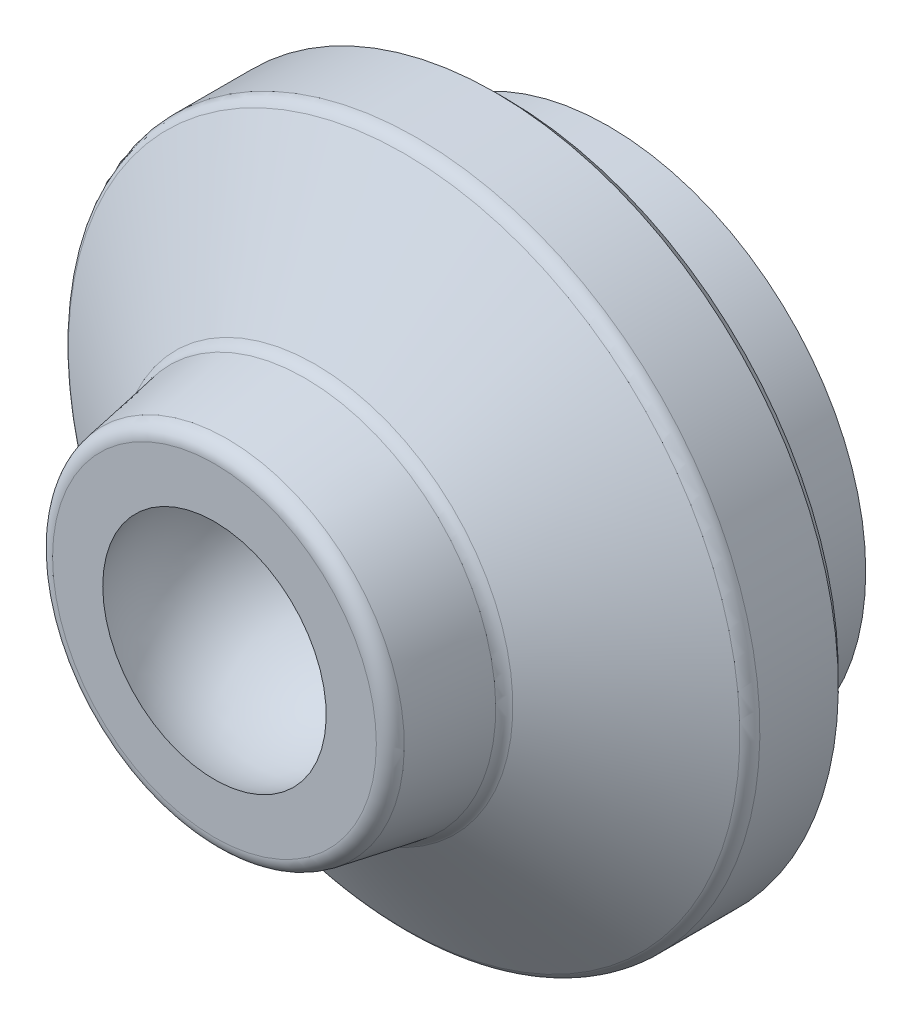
ISO-10303-21;
HEADER;
FILE_DESCRIPTION(('STEP AP214'),'2;1');
FILE_NAME('part.step','',(''),(''),'','','');
FILE_SCHEMA(('AUTOMOTIVE_DESIGN { 1 0 10303 214 1 1 1 1 }'));
ENDSEC;
DATA;
#1=APPLICATION_CONTEXT('core data for automotive mechanical design processes');
#2=APPLICATION_PROTOCOL_DEFINITION('international standard','automotive_design',2000,#1);
#3=PRODUCT_CONTEXT('',#1,'mechanical');
#4=PRODUCT('Part','Part','',(#3));
#5=PRODUCT_RELATED_PRODUCT_CATEGORY('part','',(#4));
#6=PRODUCT_DEFINITION_FORMATION('','',#4);
#7=PRODUCT_DEFINITION_CONTEXT('part definition',#1,'design');
#8=PRODUCT_DEFINITION('design','',#6,#7);
#9=PRODUCT_DEFINITION_SHAPE('','',#8);
#10=(LENGTH_UNIT() NAMED_UNIT(*) SI_UNIT(.MILLI.,.METRE.));
#11=(NAMED_UNIT(*) PLANE_ANGLE_UNIT() SI_UNIT($,.RADIAN.));
#12=(NAMED_UNIT(*) SI_UNIT($,.STERADIAN.) SOLID_ANGLE_UNIT());
#13=UNCERTAINTY_MEASURE_WITH_UNIT(LENGTH_MEASURE(1.E-05),#10,'distance_accuracy_value','');
#14=(GEOMETRIC_REPRESENTATION_CONTEXT(3) GLOBAL_UNCERTAINTY_ASSIGNED_CONTEXT((#13)) GLOBAL_UNIT_ASSIGNED_CONTEXT((#10,
#11,#12)) REPRESENTATION_CONTEXT('',''));
#15=CARTESIAN_POINT('',(0.,0.,0.));
#16=DIRECTION('',(0.,0.,1.));
#17=DIRECTION('',(1.,0.,0.));
#18=AXIS2_PLACEMENT_3D('',#15,#16,#17);
#19=CARTESIAN_POINT('',(0.,0.,20.45));
#20=DIRECTION('',(0.,0.,-1.));
#21=DIRECTION('',(-1.,0.,0.));
#22=AXIS2_PLACEMENT_3D('',#19,#20,#21);
#23=SPHERICAL_SURFACE('',#22,7.);
#24=CARTESIAN_POINT('',(0.,0.,23.));
#25=DIRECTION('',(0.,0.,-1.));
#26=DIRECTION('',(0.,1.,0.));
#27=AXIS2_PLACEMENT_3D('',#24,#25,#26);
#28=CIRCLE('',#27,6.51901066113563);
#29=CARTESIAN_POINT('',(0.,6.51901066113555,23.));
#30=VERTEX_POINT('',#29);
#31=EDGE_CURVE('E10',#30,#30,#28,.T.);
#32=ORIENTED_EDGE('',*,*,#31,.F.);
#33=EDGE_LOOP('',(#32));
#34=FACE_BOUND('',#33,.T.);
#35=ADVANCED_FACE('F14',(#34),#23,.F.);
#36=CARTESIAN_POINT('',(6.51901066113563,0.,23.));
#37=DIRECTION('',(0.,0.,-1.));
#38=DIRECTION('',(0.,1.,0.));
#39=AXIS2_PLACEMENT_3D('',#36,#37,#38);
#40=PLANE('',#39);
#41=CARTESIAN_POINT('',(0.,0.,23.));
#42=DIRECTION('',(0.,0.,-1.));
#43=DIRECTION('',(0.,1.,0.));
#44=AXIS2_PLACEMENT_3D('',#41,#42,#43);
#45=CIRCLE('',#44,9.44562410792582);
#46=CARTESIAN_POINT('',(0.,9.44562410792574,23.));
#47=VERTEX_POINT('',#46);
#48=EDGE_CURVE('E20',#47,#47,#45,.T.);
#49=ORIENTED_EDGE('',*,*,#48,.F.);
#50=EDGE_LOOP('',(#49));
#51=FACE_BOUND('',#50,.T.);
#52=ORIENTED_EDGE('',*,*,#31,.T.);
#53=EDGE_LOOP('',(#52));
#54=FACE_BOUND('',#53,.T.);
#55=ADVANCED_FACE('F95',(#51,#54),#40,.F.);
#56=CARTESIAN_POINT('',(0.,0.,22.1));
#57=DIRECTION('',(0.,0.,-1.));
#58=DIRECTION('',(0.,1.,0.));
#59=AXIS2_PLACEMENT_3D('',#56,#57,#58);
#60=TOROIDAL_SURFACE('',#59,9.44562410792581,0.9);
#61=ORIENTED_EDGE('',*,*,#48,.T.);
#62=EDGE_LOOP('',(#61));
#63=FACE_BOUND('',#62,.T.);
#64=CARTESIAN_POINT('',(0.,0.,22.2562833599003));
#65=DIRECTION('',(0.,0.,-1.));
#66=DIRECTION('',(0.,1.,0.));
#67=AXIS2_PLACEMENT_3D('',#64,#65,#66);
#68=CIRCLE('',#67,10.3319510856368);
#69=CARTESIAN_POINT('',(0.,10.3319510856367,22.2562833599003));
#70=VERTEX_POINT('',#69);
#71=EDGE_CURVE('E24',#70,#70,#68,.T.);
#72=ORIENTED_EDGE('',*,*,#71,.F.);
#73=EDGE_LOOP('',(#72));
#74=FACE_BOUND('',#73,.T.);
#75=ADVANCED_FACE('F101',(#63,#74),#60,.T.);
#76=CARTESIAN_POINT('',(0.,0.,22.2562833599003));
#77=DIRECTION('',(0.,0.,-1.));
#78=DIRECTION('',(0.,1.,0.));
#79=AXIS2_PLACEMENT_3D('',#76,#77,#78);
#80=CONICAL_SURFACE('',#79,10.3319510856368,0.174532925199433);
#81=CARTESIAN_POINT('',(0.,0.,17.7207527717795));
#82=DIRECTION('',(0.,0.,-1.));
#83=DIRECTION('',(0.,1.,0.));
#84=AXIS2_PLACEMENT_3D('',#81,#82,#83);
#85=CIRCLE('',#84,11.131687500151);
#86=CARTESIAN_POINT('',(0.,11.1316875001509,17.7207527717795));
#87=VERTEX_POINT('',#86);
#88=EDGE_CURVE('E28',#87,#87,#85,.T.);
#89=ORIENTED_EDGE('',*,*,#88,.F.);
#90=EDGE_LOOP('',(#89));
#91=FACE_BOUND('',#90,.T.);
#92=ORIENTED_EDGE('',*,*,#71,.T.);
#93=EDGE_LOOP('',(#92));
#94=FACE_BOUND('',#93,.T.);
#95=ADVANCED_FACE('F107',(#91,#94),#80,.T.);
#96=CARTESIAN_POINT('',(0.,0.,17.8770361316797));
#97=DIRECTION('',(0.,0.,-1.));
#98=DIRECTION('',(0.,1.,0.));
#99=AXIS2_PLACEMENT_3D('',#96,#97,#98);
#100=TOROIDAL_SURFACE('',#99,12.018014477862,0.9);
#101=CARTESIAN_POINT('',(0.,0.,17.1203482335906));
#102=DIRECTION('',(0.,0.,-1.));
#103=DIRECTION('',(0.,1.,0.));
#104=AXIS2_PLACEMENT_3D('',#101,#102,#103);
#105=CIRCLE('',#104,11.5307533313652);
#106=CARTESIAN_POINT('',(0.,11.5307533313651,17.1203482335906));
#107=VERTEX_POINT('',#106);
#108=EDGE_CURVE('E33',#107,#107,#105,.T.);
#109=ORIENTED_EDGE('',*,*,#108,.F.);
#110=EDGE_LOOP('',(#109));
#111=FACE_BOUND('',#110,.T.);
#112=ORIENTED_EDGE('',*,*,#88,.T.);
#113=EDGE_LOOP('',(#112));
#114=FACE_BOUND('',#113,.T.);
#115=ADVANCED_FACE('F91',(#111,#114),#100,.F.);
#116=CARTESIAN_POINT('',(0.,0.,17.1203482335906));
#117=DIRECTION('',(0.,0.,-1.));
#118=DIRECTION('',(0.,1.,0.));
#119=AXIS2_PLACEMENT_3D('',#116,#117,#118);
#120=CONICAL_SURFACE('',#119,11.5307533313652,0.99869344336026);
#121=CARTESIAN_POINT('',(0.,0.,11.9324454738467));
#122=DIRECTION('',(0.,0.,-1.));
#123=DIRECTION('',(0.,1.,0.));
#124=AXIS2_PLACEMENT_3D('',#121,#122,#123);
#125=CIRCLE('',#124,19.5872611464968);
#126=CARTESIAN_POINT('',(0.,19.5872611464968,11.9324454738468));
#127=VERTEX_POINT('',#126);
#128=EDGE_CURVE('E36',#127,#127,#125,.T.);
#129=ORIENTED_EDGE('',*,*,#128,.F.);
#130=EDGE_LOOP('',(#129));
#131=FACE_BOUND('',#130,.T.);
#132=ORIENTED_EDGE('',*,*,#108,.T.);
#133=EDGE_LOOP('',(#132));
#134=FACE_BOUND('',#133,.T.);
#135=ADVANCED_FACE('F83',(#131,#134),#120,.T.);
#136=CARTESIAN_POINT('',(0.,0.,11.1757575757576));
#137=DIRECTION('',(0.,0.,-1.));
#138=DIRECTION('',(0.,1.,0.));
#139=AXIS2_PLACEMENT_3D('',#136,#137,#138);
#140=TOROIDAL_SURFACE('',#139,19.1,0.9);
#141=ORIENTED_EDGE('',*,*,#128,.T.);
#142=EDGE_LOOP('',(#141));
#143=FACE_BOUND('',#142,.T.);
#144=CARTESIAN_POINT('',(0.,0.,11.1757575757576));
#145=DIRECTION('',(0.,0.,-1.));
#146=DIRECTION('',(0.,1.,0.));
#147=AXIS2_PLACEMENT_3D('',#144,#145,#146);
#148=CIRCLE('',#147,20.);
#149=CARTESIAN_POINT('',(0.,20.,11.1757575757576));
#150=VERTEX_POINT('',#149);
#151=EDGE_CURVE('E39',#150,#150,#148,.T.);
#152=ORIENTED_EDGE('',*,*,#151,.F.);
#153=EDGE_LOOP('',(#152));
#154=FACE_BOUND('',#153,.T.);
#155=ADVANCED_FACE('F78',(#143,#154),#140,.T.);
#156=CARTESIAN_POINT('',(0.,0.,0.));
#157=DIRECTION('',(0.,0.,-1.));
#158=DIRECTION('',(0.,1.,0.));
#159=AXIS2_PLACEMENT_3D('',#156,#157,#158);
#160=CYLINDRICAL_SURFACE('',#159,20.);
#161=CARTESIAN_POINT('',(0.,0.,6.6));
#162=DIRECTION('',(0.,0.,-1.));
#163=DIRECTION('',(0.,1.,0.));
#164=AXIS2_PLACEMENT_3D('',#161,#162,#163);
#165=CIRCLE('',#164,20.);
#166=CARTESIAN_POINT('',(0.,20.,6.60000000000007));
#167=VERTEX_POINT('',#166);
#168=EDGE_CURVE('E42',#167,#167,#165,.T.);
#169=ORIENTED_EDGE('',*,*,#168,.F.);
#170=EDGE_LOOP('',(#169));
#171=FACE_BOUND('',#170,.T.);
#172=ORIENTED_EDGE('',*,*,#151,.T.);
#173=EDGE_LOOP('',(#172));
#174=FACE_BOUND('',#173,.T.);
#175=ADVANCED_FACE('F72',(#171,#174),#160,.T.);
#176=CARTESIAN_POINT('',(0.,0.,6.6));
#177=DIRECTION('',(0.,0.,1.));
#178=DIRECTION('',(0.,-1.,0.));
#179=AXIS2_PLACEMENT_3D('',#176,#177,#178);
#180=CONICAL_SURFACE('',#179,20.,0.785398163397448);
#181=CARTESIAN_POINT('',(0.,0.,6.));
#182=DIRECTION('',(0.,0.,-1.));
#183=DIRECTION('',(0.,1.,0.));
#184=AXIS2_PLACEMENT_3D('',#181,#182,#183);
#185=CIRCLE('',#184,19.4);
#186=CARTESIAN_POINT('',(0.,19.4,6.00000000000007));
#187=VERTEX_POINT('',#186);
#188=EDGE_CURVE('E45',#187,#187,#185,.T.);
#189=ORIENTED_EDGE('',*,*,#188,.F.);
#190=EDGE_LOOP('',(#189));
#191=FACE_BOUND('',#190,.T.);
#192=ORIENTED_EDGE('',*,*,#168,.T.);
#193=EDGE_LOOP('',(#192));
#194=FACE_BOUND('',#193,.T.);
#195=ADVANCED_FACE('F66',(#191,#194),#180,.T.);
#196=CARTESIAN_POINT('',(19.4,0.,6.));
#197=DIRECTION('',(0.,0.,1.));
#198=DIRECTION('',(0.,-1.,0.));
#199=AXIS2_PLACEMENT_3D('',#196,#197,#198);
#200=PLANE('',#199);
#201=CARTESIAN_POINT('',(0.,0.,6.));
#202=DIRECTION('',(0.,0.,-1.));
#203=DIRECTION('',(0.,1.,0.));
#204=AXIS2_PLACEMENT_3D('',#201,#202,#203);
#205=CIRCLE('',#204,15.);
#206=CARTESIAN_POINT('',(0.,15.,6.00000000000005));
#207=VERTEX_POINT('',#206);
#208=EDGE_CURVE('E48',#207,#207,#205,.T.);
#209=ORIENTED_EDGE('',*,*,#208,.F.);
#210=EDGE_LOOP('',(#209));
#211=FACE_BOUND('',#210,.T.);
#212=ORIENTED_EDGE('',*,*,#188,.T.);
#213=EDGE_LOOP('',(#212));
#214=FACE_BOUND('',#213,.T.);
#215=ADVANCED_FACE('F60',(#211,#214),#200,.F.);
#216=CARTESIAN_POINT('',(0.,0.,0.));
#217=DIRECTION('',(0.,0.,-1.));
#218=DIRECTION('',(0.,1.,0.));
#219=AXIS2_PLACEMENT_3D('',#216,#217,#218);
#220=CYLINDRICAL_SURFACE('',#219,15.);
#221=CARTESIAN_POINT('',(0.,0.,0.));
#222=DIRECTION('',(0.,0.,-1.));
#223=DIRECTION('',(0.,1.,0.));
#224=AXIS2_PLACEMENT_3D('',#221,#222,#223);
#225=CIRCLE('',#224,15.);
#226=CARTESIAN_POINT('',(0.,15.,0.));
#227=VERTEX_POINT('',#226);
#228=EDGE_CURVE('E51',#227,#227,#225,.T.);
#229=ORIENTED_EDGE('',*,*,#228,.F.);
#230=EDGE_LOOP('',(#229));
#231=FACE_BOUND('',#230,.T.);
#232=ORIENTED_EDGE('',*,*,#208,.T.);
#233=EDGE_LOOP('',(#232));
#234=FACE_BOUND('',#233,.T.);
#235=ADVANCED_FACE('F57',(#231,#234),#220,.T.);
#236=CARTESIAN_POINT('',(15.,0.,0.));
#237=DIRECTION('',(0.,0.,1.));
#238=DIRECTION('',(0.,-1.,0.));
#239=AXIS2_PLACEMENT_3D('',#236,#237,#238);
#240=PLANE('',#239);
#241=ORIENTED_EDGE('',*,*,#228,.T.);
#242=EDGE_LOOP('',(#241));
#243=FACE_BOUND('',#242,.T.);
#244=ADVANCED_FACE('F55',(#243),#240,.F.);
#245=CLOSED_SHELL('',(#35,#55,#75,#95,#115,#135,#155,#175,#195,#215,#235,#244));
#246=MANIFOLD_SOLID_BREP('B1',#245);
#247=ADVANCED_BREP_SHAPE_REPRESENTATION('',(#18,#246),#14);
#248=SHAPE_DEFINITION_REPRESENTATION(#9,#247);
ENDSEC;
END-ISO-10303-21;
